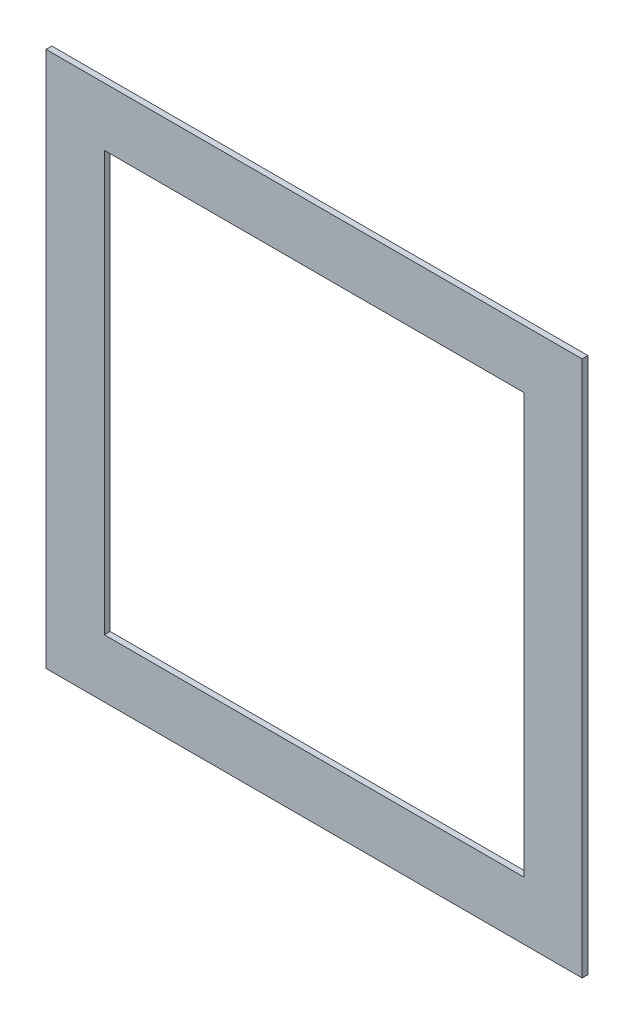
from build123d import *

# Parameters (mm, degrees)
SKETCH1_W           = 460
SKETCH1_H           = 460
SKETCH1_W_2         = 360
SKETCH1_H_2         = 360
BOSS_EXTRUDE1_DEPTH = 2.5


with BuildPart() as part:
    # Sketch1 → Boss-Extrude1 (new, symmetric)
    with BuildSketch(Plane.XY):
        Rectangle(SKETCH1_W, SKETCH1_H)
        Rectangle(SKETCH1_W_2, SKETCH1_H_2, mode=Mode.SUBTRACT)
    extrude(amount=BOSS_EXTRUDE1_DEPTH, both=True)


solid = part.part
